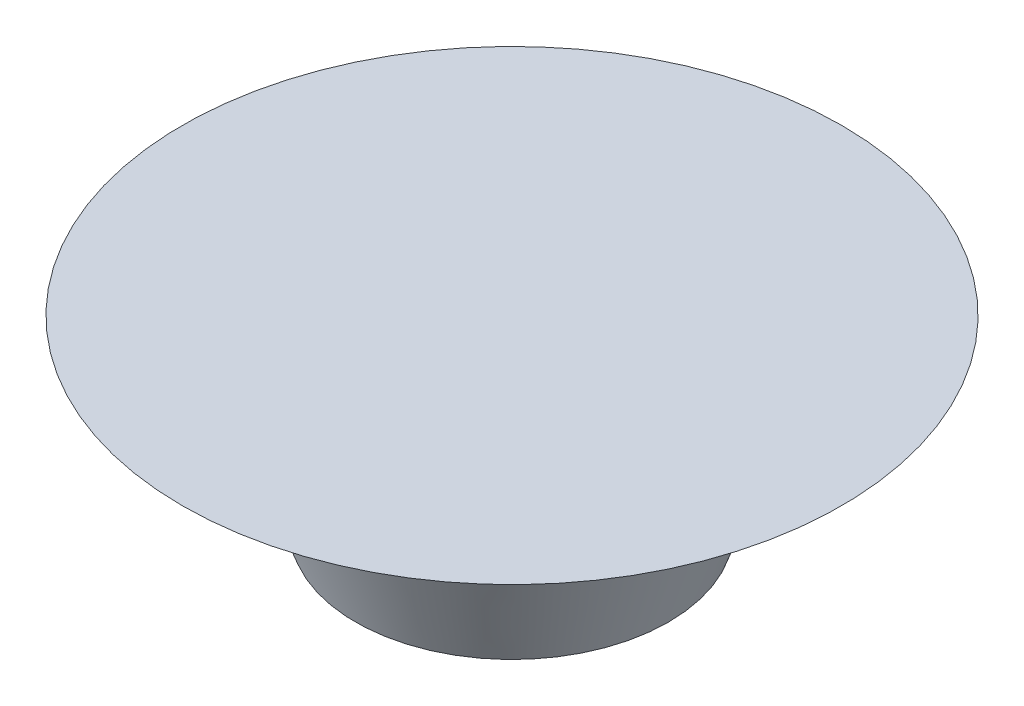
ISO-10303-21;
HEADER;
FILE_DESCRIPTION(('STEP AP214'),'2;1');
FILE_NAME('part.step','',(''),(''),'','','');
FILE_SCHEMA(('AUTOMOTIVE_DESIGN { 1 0 10303 214 1 1 1 1 }'));
ENDSEC;
DATA;
#1=APPLICATION_CONTEXT('core data for automotive mechanical design processes');
#2=APPLICATION_PROTOCOL_DEFINITION('international standard','automotive_design',2000,#1);
#3=PRODUCT_CONTEXT('',#1,'mechanical');
#4=PRODUCT('Part','Part','',(#3));
#5=PRODUCT_RELATED_PRODUCT_CATEGORY('part','',(#4));
#6=PRODUCT_DEFINITION_FORMATION('','',#4);
#7=PRODUCT_DEFINITION_CONTEXT('part definition',#1,'design');
#8=PRODUCT_DEFINITION('design','',#6,#7);
#9=PRODUCT_DEFINITION_SHAPE('','',#8);
#10=(LENGTH_UNIT() NAMED_UNIT(*) SI_UNIT(.MILLI.,.METRE.));
#11=(NAMED_UNIT(*) PLANE_ANGLE_UNIT() SI_UNIT($,.RADIAN.));
#12=(NAMED_UNIT(*) SI_UNIT($,.STERADIAN.) SOLID_ANGLE_UNIT());
#13=UNCERTAINTY_MEASURE_WITH_UNIT(LENGTH_MEASURE(1.E-05),#10,'distance_accuracy_value','');
#14=(GEOMETRIC_REPRESENTATION_CONTEXT(3) GLOBAL_UNCERTAINTY_ASSIGNED_CONTEXT((#13)) GLOBAL_UNIT_ASSIGNED_CONTEXT((#10,
#11,#12)) REPRESENTATION_CONTEXT('',''));
#15=CARTESIAN_POINT('',(0.,0.,0.));
#16=DIRECTION('',(0.,0.,1.));
#17=DIRECTION('',(1.,0.,0.));
#18=AXIS2_PLACEMENT_3D('',#15,#16,#17);
#19=CARTESIAN_POINT('',(4.18014882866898,-5.,0.));
#20=DIRECTION('',(0.,-1.,0.));
#21=DIRECTION('',(1.,0.,0.));
#22=AXIS2_PLACEMENT_3D('',#19,#20,#21);
#23=PLANE('',#22);
#24=CARTESIAN_POINT('',(0.,-5.,0.));
#25=DIRECTION('',(0.,1.,0.));
#26=DIRECTION('',(-1.,0.,0.));
#27=AXIS2_PLACEMENT_3D('',#24,#25,#26);
#28=CIRCLE('',#27,4.18014882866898);
#29=CARTESIAN_POINT('',(-4.18014882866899,-5.,0.));
#30=VERTEX_POINT('',#29);
#31=EDGE_CURVE('E38',#30,#30,#28,.T.);
#32=ORIENTED_EDGE('',*,*,#31,.F.);
#33=EDGE_LOOP('',(#32));
#34=FACE_BOUND('',#33,.T.);
#35=ADVANCED_FACE('F32',(#34),#23,.T.);
#36=CARTESIAN_POINT('',(0.,0.,0.));
#37=DIRECTION('',(0.,1.,0.));
#38=DIRECTION('',(-1.,0.,0.));
#39=AXIS2_PLACEMENT_3D('',#36,#37,#38);
#40=CONICAL_SURFACE('',#39,6.,0.349065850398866);
#41=CARTESIAN_POINT('',(0.,-2.63191942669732,0.));
#42=DIRECTION('',(0.,1.,0.));
#43=DIRECTION('',(-1.,0.,0.));
#44=AXIS2_PLACEMENT_3D('',#41,#42,#43);
#45=CIRCLE('',#44,5.0420596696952);
#46=CARTESIAN_POINT('',(-5.0420596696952,-2.63191942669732,0.));
#47=VERTEX_POINT('',#46);
#48=EDGE_CURVE('E10',#47,#47,#45,.F.);
#49=ORIENTED_EDGE('',*,*,#48,.T.);
#50=EDGE_LOOP('',(#49));
#51=FACE_BOUND('',#50,.T.);
#52=ORIENTED_EDGE('',*,*,#31,.T.);
#53=EDGE_LOOP('',(#52));
#54=FACE_BOUND('',#53,.T.);
#55=ADVANCED_FACE('F54',(#51,#54),#40,.T.);
#56=CARTESIAN_POINT('',(0.,-4.,0.));
#57=DIRECTION('',(0.,-1.,0.));
#58=DIRECTION('',(0.,0.,-1.));
#59=AXIS2_PLACEMENT_3D('',#56,#57,#58);
#60=TOROIDAL_SURFACE('',#59,8.80083015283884,4.);
#61=CARTESIAN_POINT('',(0.,0.,0.));
#62=DIRECTION('',(0.,-1.,0.));
#63=DIRECTION('',(0.,0.,-1.));
#64=AXIS2_PLACEMENT_3D('',#61,#62,#63);
#65=CIRCLE('',#64,8.80083015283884);
#66=CARTESIAN_POINT('',(0.,0.,-8.80083015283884));
#67=VERTEX_POINT('',#66);
#68=EDGE_CURVE('E42',#67,#67,#65,.F.);
#69=ORIENTED_EDGE('',*,*,#68,.F.);
#70=EDGE_LOOP('',(#69));
#71=FACE_BOUND('',#70,.T.);
#72=ORIENTED_EDGE('',*,*,#48,.F.);
#73=EDGE_LOOP('',(#72));
#74=FACE_BOUND('',#73,.T.);
#75=ADVANCED_FACE('F51',(#71,#74),#60,.F.);
#76=CARTESIAN_POINT('',(-25.,0.,25.));
#77=DIRECTION('',(0.,-1.,0.));
#78=DIRECTION('',(0.,0.,-1.));
#79=AXIS2_PLACEMENT_3D('',#76,#77,#78);
#80=PLANE('',#79);
#81=ORIENTED_EDGE('',*,*,#68,.T.);
#82=EDGE_LOOP('',(#81));
#83=FACE_BOUND('',#82,.T.);
#84=ADVANCED_FACE('F49',(#83),#80,.F.);
#85=CLOSED_SHELL('',(#35,#55,#75,#84));
#86=MANIFOLD_SOLID_BREP('B2',#85);
#87=ADVANCED_BREP_SHAPE_REPRESENTATION('',(#18,#86),#14);
#88=SHAPE_DEFINITION_REPRESENTATION(#9,#87);
ENDSEC;
END-ISO-10303-21;
